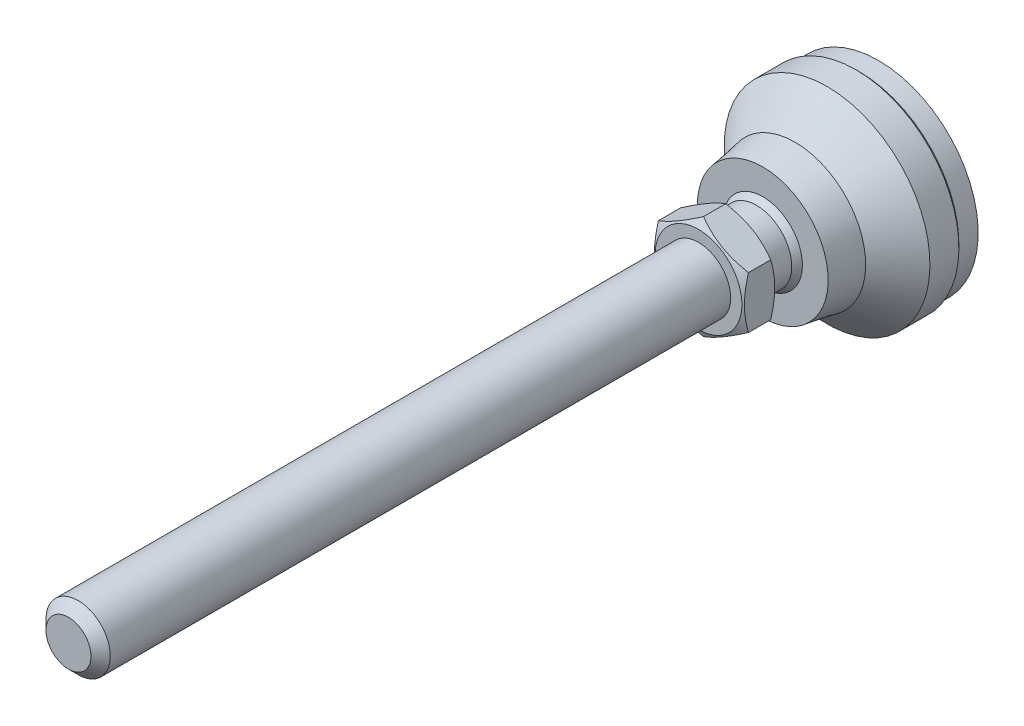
ISO-10303-21;
HEADER;
FILE_DESCRIPTION(('STEP AP214'),'2;1');
FILE_NAME('part.step','',(''),(''),'','','');
FILE_SCHEMA(('AUTOMOTIVE_DESIGN { 1 0 10303 214 1 1 1 1 }'));
ENDSEC;
DATA;
#1=APPLICATION_CONTEXT('core data for automotive mechanical design processes');
#2=APPLICATION_PROTOCOL_DEFINITION('international standard','automotive_design',2000,#1);
#3=PRODUCT_CONTEXT('',#1,'mechanical');
#4=PRODUCT('Part','Part','',(#3));
#5=PRODUCT_RELATED_PRODUCT_CATEGORY('part','',(#4));
#6=PRODUCT_DEFINITION_FORMATION('','',#4);
#7=PRODUCT_DEFINITION_CONTEXT('part definition',#1,'design');
#8=PRODUCT_DEFINITION('design','',#6,#7);
#9=PRODUCT_DEFINITION_SHAPE('','',#8);
#10=(LENGTH_UNIT() NAMED_UNIT(*) SI_UNIT(.MILLI.,.METRE.));
#11=(NAMED_UNIT(*) PLANE_ANGLE_UNIT() SI_UNIT($,.RADIAN.));
#12=(NAMED_UNIT(*) SI_UNIT($,.STERADIAN.) SOLID_ANGLE_UNIT());
#13=UNCERTAINTY_MEASURE_WITH_UNIT(LENGTH_MEASURE(1.E-05),#10,'distance_accuracy_value','');
#14=(GEOMETRIC_REPRESENTATION_CONTEXT(3) GLOBAL_UNCERTAINTY_ASSIGNED_CONTEXT((#13)) GLOBAL_UNIT_ASSIGNED_CONTEXT((#10,
#11,#12)) REPRESENTATION_CONTEXT('',''));
#15=CARTESIAN_POINT('',(0.,0.,0.));
#16=DIRECTION('',(0.,0.,1.));
#17=DIRECTION('',(1.,0.,0.));
#18=AXIS2_PLACEMENT_3D('',#15,#16,#17);
#19=CARTESIAN_POINT('',(0.,0.,3.));
#20=DIRECTION('',(0.,0.,-1.));
#21=DIRECTION('',(0.,1.,0.));
#22=AXIS2_PLACEMENT_3D('',#19,#20,#21);
#23=CYLINDRICAL_SURFACE('',#22,5.49999999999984);
#24=CARTESIAN_POINT('',(0.,0.,23.));
#25=DIRECTION('',(0.,0.,-1.));
#26=DIRECTION('',(0.,1.,0.));
#27=AXIS2_PLACEMENT_3D('',#24,#25,#26);
#28=CIRCLE('',#27,5.49999999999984);
#29=CARTESIAN_POINT('',(0.,5.49999999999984,23.));
#30=VERTEX_POINT('',#29);
#31=EDGE_CURVE('E112',#30,#30,#28,.T.);
#32=ORIENTED_EDGE('',*,*,#31,.T.);
#33=EDGE_LOOP('',(#32));
#34=FACE_BOUND('',#33,.T.);
#35=CARTESIAN_POINT('',(0.,0.,19.0000000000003));
#36=DIRECTION('',(0.,0.,1.));
#37=DIRECTION('',(0.,-1.,0.));
#38=AXIS2_PLACEMENT_3D('',#35,#36,#37);
#39=CIRCLE('',#38,5.49999999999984);
#40=CARTESIAN_POINT('',(-5.49999999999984,0.,19.0000000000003));
#41=VERTEX_POINT('',#40);
#42=EDGE_CURVE('E115',#41,#41,#39,.T.);
#43=ORIENTED_EDGE('',*,*,#42,.T.);
#44=EDGE_LOOP('',(#43));
#45=FACE_BOUND('',#44,.T.);
#46=ADVANCED_FACE('F14',(#34,#45),#23,.T.);
#47=CARTESIAN_POINT('',(0.,0.,14.6698729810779));
#48=DIRECTION('',(0.,0.,1.));
#49=DIRECTION('',(-1.,0.,0.));
#50=AXIS2_PLACEMENT_3D('',#47,#48,#49);
#51=SPHERICAL_SURFACE('',#50,7.);
#52=CARTESIAN_POINT('',(0.,0.,18.));
#53=DIRECTION('',(0.,0.,1.));
#54=DIRECTION('',(0.,-1.,0.));
#55=AXIS2_PLACEMENT_3D('',#52,#53,#54);
#56=CIRCLE('',#55,6.15713034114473);
#57=CARTESIAN_POINT('',(-6.15713034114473,0.,18.));
#58=VERTEX_POINT('',#57);
#59=EDGE_CURVE('E284',#58,#58,#56,.T.);
#60=CARTESIAN_POINT('',(-5.49999999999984,0.,19.0000000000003));
#61=CARTESIAN_POINT('',(-5.50771979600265,0.,18.9901945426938));
#62=CARTESIAN_POINT('',(-5.51541336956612,0.,18.9803684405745));
#63=CARTESIAN_POINT('',(-5.53074785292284,0.,18.9606752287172));
#64=CARTESIAN_POINT('',(-5.53838876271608,0.,18.9508081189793));
#65=CARTESIAN_POINT('',(-5.55361769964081,0.,18.9310331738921));
#66=CARTESIAN_POINT('',(-5.56120572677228,0.,18.9211253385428));
#67=CARTESIAN_POINT('',(-5.57632868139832,0.,18.9012692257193));
#68=CARTESIAN_POINT('',(-5.58386360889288,0.,18.8913209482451));
#69=CARTESIAN_POINT('',(-5.59888014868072,0.,18.871384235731));
#70=CARTESIAN_POINT('',(-5.60636176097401,0.,18.8613958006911));
#71=CARTESIAN_POINT('',(-5.62127145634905,0.,18.841379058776));
#72=CARTESIAN_POINT('',(-5.62869953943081,0.,18.8313507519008));
#73=CARTESIAN_POINT('',(-5.64350196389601,0.,18.81125455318));
#74=CARTESIAN_POINT('',(-5.65087630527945,0.,18.8011866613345));
#75=CARTESIAN_POINT('',(-5.66557103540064,0.,18.781011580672));
#76=CARTESIAN_POINT('',(-5.67289142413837,0.,18.770904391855));
#77=CARTESIAN_POINT('',(-5.68747803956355,0.,18.7506510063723));
#78=CARTESIAN_POINT('',(-5.69474426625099,0.,18.7405048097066));
#79=CARTESIAN_POINT('',(-5.70922234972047,0.,18.7201736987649));
#80=CARTESIAN_POINT('',(-5.7164342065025,0.,18.7099887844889));
#81=CARTESIAN_POINT('',(-5.7308033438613,0.,18.6895805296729));
#82=CARTESIAN_POINT('',(-5.73796062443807,0.,18.6793571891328));
#83=CARTESIAN_POINT('',(-5.75222040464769,0.,18.6588723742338));
#84=CARTESIAN_POINT('',(-5.75932290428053,0.,18.6486108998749));
#85=CARTESIAN_POINT('',(-5.77347291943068,0.,18.6280501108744));
#86=CARTESIAN_POINT('',(-5.78052043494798,0.,18.6177507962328));
#87=CARTESIAN_POINT('',(-5.79456028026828,0.,18.5971146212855));
#88=CARTESIAN_POINT('',(-5.80155261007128,0.,18.5867777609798));
#89=CARTESIAN_POINT('',(-5.81548188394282,0.,18.5660667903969));
#90=CARTESIAN_POINT('',(-5.82241882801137,0.,18.5556926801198));
#91=CARTESIAN_POINT('',(-5.83623713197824,0.,18.5349075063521));
#92=CARTESIAN_POINT('',(-5.84311849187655,0.,18.5244964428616));
#93=CARTESIAN_POINT('',(-5.85682543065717,0.,18.5036376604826));
#94=CARTESIAN_POINT('',(-5.86365100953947,0.,18.493189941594));
#95=CARTESIAN_POINT('',(-5.87724619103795,0.,18.4722581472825));
#96=CARTESIAN_POINT('',(-5.88401579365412,0.,18.4617740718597));
#97=CARTESIAN_POINT('',(-5.89749882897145,0.,18.4407698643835));
#98=CARTESIAN_POINT('',(-5.90421226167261,0.,18.4302497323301));
#99=CARTESIAN_POINT('',(-5.91758276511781,0.,18.4091737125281));
#100=CARTESIAN_POINT('',(-5.92423983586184,0.,18.3986178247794));
#101=CARTESIAN_POINT('',(-5.93749742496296,0.,18.3774705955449));
#102=CARTESIAN_POINT('',(-5.94409794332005,0.,18.366879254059));
#103=CARTESIAN_POINT('',(-5.95724223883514,0.,18.3456614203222));
#104=CARTESIAN_POINT('',(-5.96378601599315,0.,18.3350349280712));
#105=CARTESIAN_POINT('',(-5.9768166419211,0.,18.313747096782));
#106=CARTESIAN_POINT('',(-5.98330349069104,0.,18.3030857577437));
#107=CARTESIAN_POINT('',(-5.99622007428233,0.,18.2817285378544));
#108=CARTESIAN_POINT('',(-6.00264980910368,0.,18.2710326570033));
#109=CARTESIAN_POINT('',(-6.015451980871,0.,18.249606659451));
#110=CARTESIAN_POINT('',(-6.02182441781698,0.,18.2388765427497));
#111=CARTESIAN_POINT('',(-6.034511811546,0.,18.217382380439));
#112=CARTESIAN_POINT('',(-6.04082676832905,0.,18.2066183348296));
#113=CARTESIAN_POINT('',(-6.05339902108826,0.,18.1850566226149));
#114=CARTESIAN_POINT('',(-6.05965631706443,0.,18.1742589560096));
#115=CARTESIAN_POINT('',(-6.07211306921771,0.,18.1526303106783));
#116=CARTESIAN_POINT('',(-6.07831252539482,0.,18.1417993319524));
#117=CARTESIAN_POINT('',(-6.09065342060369,0.,18.1201043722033));
#118=CARTESIAN_POINT('',(-6.09679485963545,0.,18.1092403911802));
#119=CARTESIAN_POINT('',(-6.10901954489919,0.,18.0874797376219));
#120=CARTESIAN_POINT('',(-6.11510279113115,0.,18.0765830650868));
#121=CARTESIAN_POINT('',(-6.12721091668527,0.,18.054757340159));
#122=CARTESIAN_POINT('',(-6.13323579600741,0.,18.0438282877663));
#123=CARTESIAN_POINT('',(-6.14522701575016,0.,18.0219381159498));
#124=CARTESIAN_POINT('',(-6.15119335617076,0.,18.010976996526));
#125=CARTESIAN_POINT('',(-6.15713034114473,0.,18.));
#126=B_SPLINE_CURVE_WITH_KNOTS('',3,(#60,#61,#62,#63,#64,#65,#66,#67,#68,#69,#70,#71,#72,#73,
#74,#75,#76,#77,#78,#79,#80,#81,#82,#83,#84,#85,#86,#87,#88,#89,#90,#91,#92,#93,#94,#95,#96,#97,
#98,#99,#100,#101,#102,#103,#104,#105,#106,#107,#108,#109,#110,#111,#112,#113,#114,#115,#116,
#117,#118,#119,#120,#121,#122,#123,#124,#125),.UNSPECIFIED.,.F.,.F.,(4,2,2,2,2,2,2,2,2,2,2,2,2,
2,2,2,2,2,2,2,2,2,2,2,2,2,2,2,2,2,2,2,4),(0.,0.0374389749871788,0.0748779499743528,
0.112316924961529,0.149755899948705,0.187194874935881,0.224633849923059,0.262072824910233,
0.29951179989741,0.336950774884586,0.374389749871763,0.411828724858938,0.449267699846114,
0.486706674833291,0.524145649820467,0.561584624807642,0.599023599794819,0.636462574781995,
0.673901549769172,0.711340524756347,0.748779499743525,0.786218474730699,0.823657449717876,
0.86109642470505,0.898535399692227,0.935974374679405,0.973413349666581,1.01085232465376,
1.04829129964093,1.08573027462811,1.12316924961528,1.16060822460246,1.19804719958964),.UNSPECIFIED.);
#127=EDGE_CURVE('BSEAM243',#41,#58,#126,.T.);
#128=ORIENTED_EDGE('',*,*,#42,.F.);
#129=ORIENTED_EDGE('',*,*,#59,.T.);
#130=ORIENTED_EDGE('',*,*,#127,.T.);
#131=ORIENTED_EDGE('',*,*,#127,.F.);
#132=EDGE_LOOP('',(#128,#130,#129,#131));
#133=FACE_BOUND('',#132,.T.);
#134=ADVANCED_FACE('F243',(#133),#51,.T.);
#135=CARTESIAN_POINT('',(0.,0.,3.50000000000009));
#136=DIRECTION('',(0.,0.,1.));
#137=DIRECTION('',(0.,-1.,0.));
#138=AXIS2_PLACEMENT_3D('',#135,#136,#137);
#139=CONICAL_SURFACE('',#138,16.,0.785398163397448);
#140=CARTESIAN_POINT('',(0.,0.,3.00000000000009));
#141=DIRECTION('',(0.,0.,-1.));
#142=DIRECTION('',(0.,1.,0.));
#143=AXIS2_PLACEMENT_3D('',#140,#141,#142);
#144=CIRCLE('',#143,15.5);
#145=CARTESIAN_POINT('',(0.,15.5,3.00000000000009));
#146=VERTEX_POINT('',#145);
#147=EDGE_CURVE('E85',#146,#146,#144,.T.);
#148=ORIENTED_EDGE('',*,*,#147,.F.);
#149=EDGE_LOOP('',(#148));
#150=FACE_BOUND('',#149,.T.);
#151=CARTESIAN_POINT('',(0.,0.,3.50000000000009));
#152=DIRECTION('',(0.,0.,-1.));
#153=DIRECTION('',(0.,1.,0.));
#154=AXIS2_PLACEMENT_3D('',#151,#152,#153);
#155=CIRCLE('',#154,16.);
#156=CARTESIAN_POINT('',(0.,16.,3.50000000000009));
#157=VERTEX_POINT('',#156);
#158=EDGE_CURVE('E88',#157,#157,#155,.T.);
#159=ORIENTED_EDGE('',*,*,#158,.T.);
#160=EDGE_LOOP('',(#159));
#161=FACE_BOUND('',#160,.T.);
#162=ADVANCED_FACE('F246',(#150,#161),#139,.T.);
#163=CARTESIAN_POINT('',(0.,0.,3.));
#164=DIRECTION('',(0.,0.,-1.));
#165=DIRECTION('',(0.,1.,0.));
#166=AXIS2_PLACEMENT_3D('',#163,#164,#165);
#167=CYLINDRICAL_SURFACE('',#166,16.);
#168=ORIENTED_EDGE('',*,*,#158,.F.);
#169=EDGE_LOOP('',(#168));
#170=FACE_BOUND('',#169,.T.);
#171=CARTESIAN_POINT('',(0.,0.,8.00000000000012));
#172=DIRECTION('',(0.,0.,-1.));
#173=DIRECTION('',(0.,1.,0.));
#174=AXIS2_PLACEMENT_3D('',#171,#172,#173);
#175=CIRCLE('',#174,16.);
#176=CARTESIAN_POINT('',(0.,16.,8.00000000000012));
#177=VERTEX_POINT('',#176);
#178=EDGE_CURVE('E105',#177,#177,#175,.T.);
#179=ORIENTED_EDGE('',*,*,#178,.T.);
#180=EDGE_LOOP('',(#179));
#181=FACE_BOUND('',#180,.T.);
#182=ADVANCED_FACE('F391',(#170,#181),#167,.T.);
#183=CARTESIAN_POINT('',(0.,0.,13.));
#184=DIRECTION('',(0.,0.,-1.));
#185=DIRECTION('',(0.,1.,0.));
#186=AXIS2_PLACEMENT_3D('',#183,#184,#185);
#187=CONICAL_SURFACE('',#186,11.,0.785398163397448);
#188=ORIENTED_EDGE('',*,*,#178,.F.);
#189=EDGE_LOOP('',(#188));
#190=FACE_BOUND('',#189,.T.);
#191=CARTESIAN_POINT('',(0.,0.,13.));
#192=DIRECTION('',(0.,0.,-1.));
#193=DIRECTION('',(0.,1.,0.));
#194=AXIS2_PLACEMENT_3D('',#191,#192,#193);
#195=CIRCLE('',#194,11.);
#196=CARTESIAN_POINT('',(0.,11.,13.));
#197=VERTEX_POINT('',#196);
#198=EDGE_CURVE('E108',#197,#197,#195,.T.);
#199=ORIENTED_EDGE('',*,*,#198,.T.);
#200=EDGE_LOOP('',(#199));
#201=FACE_BOUND('',#200,.T.);
#202=ADVANCED_FACE('F398',(#190,#201),#187,.T.);
#203=CARTESIAN_POINT('',(0.,0.,19.));
#204=DIRECTION('',(0.,0.,-1.));
#205=DIRECTION('',(0.,1.,0.));
#206=AXIS2_PLACEMENT_3D('',#203,#204,#205);
#207=CONICAL_SURFACE('',#206,10.,0.165148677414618);
#208=ORIENTED_EDGE('',*,*,#198,.F.);
#209=EDGE_LOOP('',(#208));
#210=FACE_BOUND('',#209,.T.);
#211=CARTESIAN_POINT('',(0.,0.,18.));
#212=DIRECTION('',(0.,0.,-1.));
#213=DIRECTION('',(0.,1.,0.));
#214=AXIS2_PLACEMENT_3D('',#211,#212,#213);
#215=CIRCLE('',#214,10.1666666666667);
#216=CARTESIAN_POINT('',(0.,10.1666666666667,18.));
#217=VERTEX_POINT('',#216);
#218=EDGE_CURVE('E93',#217,#217,#215,.T.);
#219=ORIENTED_EDGE('',*,*,#218,.T.);
#220=EDGE_LOOP('',(#219));
#221=FACE_BOUND('',#220,.T.);
#222=ADVANCED_FACE('F241',(#210,#221),#207,.T.);
#223=CARTESIAN_POINT('',(-10.1666666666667,0.,18.));
#224=DIRECTION('',(0.,0.,1.));
#225=DIRECTION('',(0.,-1.,0.));
#226=AXIS2_PLACEMENT_3D('',#223,#224,#225);
#227=PLANE('',#226);
#228=ORIENTED_EDGE('',*,*,#218,.F.);
#229=EDGE_LOOP('',(#228));
#230=FACE_BOUND('',#229,.T.);
#231=ORIENTED_EDGE('',*,*,#59,.F.);
#232=EDGE_LOOP('',(#231));
#233=FACE_BOUND('',#232,.T.);
#234=ADVANCED_FACE('F236',(#230,#233),#227,.T.);
#235=CARTESIAN_POINT('',(0.,-8.08290376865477,23.));
#236=DIRECTION('',(0.,0.,-1.));
#237=DIRECTION('',(0.,1.,0.));
#238=AXIS2_PLACEMENT_3D('',#235,#236,#237);
#239=PLANE('',#238);
#240=CARTESIAN_POINT('',(0.,0.,23.));
#241=DIRECTION('',(0.,0.,1.));
#242=DIRECTION('',(0.,-1.,0.));
#243=AXIS2_PLACEMENT_3D('',#240,#241,#242);
#244=CIRCLE('',#243,6.75);
#245=CARTESIAN_POINT('',(0.,-6.75,23.));
#246=VERTEX_POINT('',#245);
#247=EDGE_CURVE('E80',#246,#246,#244,.T.);
#248=ORIENTED_EDGE('',*,*,#247,.F.);
#249=EDGE_LOOP('',(#248));
#250=FACE_BOUND('',#249,.T.);
#251=ORIENTED_EDGE('',*,*,#31,.F.);
#252=EDGE_LOOP('',(#251));
#253=FACE_BOUND('',#252,.T.);
#254=ADVANCED_FACE('F240',(#250,#253),#239,.T.);
#255=CARTESIAN_POINT('',(0.,0.,0.));
#256=DIRECTION('',(0.,0.,1.));
#257=DIRECTION('',(0.,-1.,0.));
#258=AXIS2_PLACEMENT_3D('',#255,#256,#257);
#259=CYLINDRICAL_SURFACE('',#258,15.5);
#260=CARTESIAN_POINT('',(0.,0.,0.));
#261=DIRECTION('',(0.,0.,-1.));
#262=DIRECTION('',(0.,1.,0.));
#263=AXIS2_PLACEMENT_3D('',#260,#261,#262);
#264=CIRCLE('',#263,15.5);
#265=CARTESIAN_POINT('',(0.,15.5,0.));
#266=VERTEX_POINT('',#265);
#267=EDGE_CURVE('E292',#266,#266,#264,.T.);
#268=ORIENTED_EDGE('',*,*,#267,.F.);
#269=EDGE_LOOP('',(#268));
#270=FACE_BOUND('',#269,.T.);
#271=ORIENTED_EDGE('',*,*,#147,.T.);
#272=EDGE_LOOP('',(#271));
#273=FACE_BOUND('',#272,.T.);
#274=ADVANCED_FACE('F250',(#270,#273),#259,.T.);
#275=CARTESIAN_POINT('',(0.,0.,0.));
#276=DIRECTION('',(0.,0.,-1.));
#277=DIRECTION('',(0.,1.,0.));
#278=AXIS2_PLACEMENT_3D('',#275,#276,#277);
#279=PLANE('',#278);
#280=ORIENTED_EDGE('',*,*,#267,.T.);
#281=EDGE_LOOP('',(#280));
#282=FACE_BOUND('',#281,.T.);
#283=ADVANCED_FACE('F133',(#282),#279,.T.);
#284=CARTESIAN_POINT('',(0.,0.,23.));
#285=DIRECTION('',(0.,0.,1.));
#286=DIRECTION('',(0.,-1.,0.));
#287=AXIS2_PLACEMENT_3D('',#284,#285,#286);
#288=CONICAL_SURFACE('',#287,6.75,1.0471975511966);
#289=CARTESIAN_POINT('',(7.0002,-4.04133641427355,23.7696190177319));
#290=CARTESIAN_POINT('',(6.84633209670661,-4.13017208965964,23.7183374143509));
#291=CARTESIAN_POINT('',(6.69189049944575,-4.21933898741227,23.669383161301));
#292=CARTESIAN_POINT('',(6.38175307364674,-4.3983969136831,23.5767703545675));
#293=CARTESIAN_POINT('',(6.22605673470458,-4.4882882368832,23.5331140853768));
#294=CARTESIAN_POINT('',(5.75647483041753,-4.7594014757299,23.4109491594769));
#295=CARTESIAN_POINT('',(5.4407356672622,-4.94169356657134,23.3414631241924));
#296=CARTESIAN_POINT('',(4.96823775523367,-5.21449036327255,23.2599825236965));
#297=CARTESIAN_POINT('',(4.81289077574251,-5.30417998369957,23.2367710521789));
#298=CARTESIAN_POINT('',(4.50149488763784,-5.48396448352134,23.1978487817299));
#299=CARTESIAN_POINT('',(4.34544604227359,-5.57405932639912,23.1821373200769));
#300=CARTESIAN_POINT('',(4.03307732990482,-5.75440548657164,23.1586154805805));
#301=CARTESIAN_POINT('',(3.87675797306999,-5.84465650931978,23.1507961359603));
#302=CARTESIAN_POINT('',(3.56398349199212,-6.02523694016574,23.1432178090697));
#303=CARTESIAN_POINT('',(3.40752837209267,-6.11556634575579,23.1434585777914));
#304=CARTESIAN_POINT('',(2.97889312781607,-6.36303901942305,23.155197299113));
#305=CARTESIAN_POINT('',(2.7068533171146,-6.52010127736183,23.1749033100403));
#306=CARTESIAN_POINT('',(2.1645805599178,-6.83318259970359,23.2373910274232));
#307=CARTESIAN_POINT('',(1.89434952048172,-6.98920056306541,23.2801940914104));
#308=CARTESIAN_POINT('',(1.35098545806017,-7.30291195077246,23.3871892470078));
#309=CARTESIAN_POINT('',(1.07792099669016,-7.46056579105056,23.4518346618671));
#310=CARTESIAN_POINT('',(0.535864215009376,-7.77352241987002,23.5985536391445));
#311=CARTESIAN_POINT('',(0.266864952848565,-7.92882921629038,23.680592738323));
#312=CARTESIAN_POINT('',(-0.000199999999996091,-8.08301923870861,23.7696190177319));
#313=B_SPLINE_CURVE_WITH_KNOTS('',3,(#289,#290,#291,#292,#293,#294,#295,#296,#297,#298,#299,
#300,#301,#302,#303,#304,#305,#306,#307,#308,#309,#310,#311,#312),.UNSPECIFIED.,.F.,.F.,(4,2,2,
2,2,2,2,2,2,2,2,4),(0.,0.554727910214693,1.10969417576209,2.2219327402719,2.76443041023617,
3.30688013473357,3.8487128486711,4.39052882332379,5.33376515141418,6.27787517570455,
7.24292418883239,8.20607866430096),.UNSPECIFIED.);
#314=CARTESIAN_POINT('',(7.,-4.04145188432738,23.7695523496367));
#315=VERTEX_POINT('',#314);
#316=CARTESIAN_POINT('',(0.,-8.08290376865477,23.7695523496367));
#317=VERTEX_POINT('',#316);
#318=EDGE_CURVE('E33',#315,#317,#313,.T.);
#319=ORIENTED_EDGE('',*,*,#318,.T.);
#320=CARTESIAN_POINT('',(0.000200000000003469,-8.0830192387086,23.7696190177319));
#321=CARTESIAN_POINT('',(-0.153667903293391,-7.99418356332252,23.7183374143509));
#322=CARTESIAN_POINT('',(-0.30810950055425,-7.90501666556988,23.669383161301));
#323=CARTESIAN_POINT('',(-0.618246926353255,-7.72595873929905,23.5767703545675));
#324=CARTESIAN_POINT('',(-0.773943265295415,-7.63606741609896,23.5331140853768));
#325=CARTESIAN_POINT('',(-1.24352516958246,-7.36495417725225,23.4109491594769));
#326=CARTESIAN_POINT('',(-1.5592643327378,-7.18266208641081,23.3414631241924));
#327=CARTESIAN_POINT('',(-2.03176224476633,-6.90986528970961,23.2599825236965));
#328=CARTESIAN_POINT('',(-2.18710922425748,-6.82017566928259,23.2367710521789));
#329=CARTESIAN_POINT('',(-2.49850511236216,-6.64039116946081,23.1978487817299));
#330=CARTESIAN_POINT('',(-2.65455395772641,-6.55029632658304,23.1821373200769));
#331=CARTESIAN_POINT('',(-2.96692267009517,-6.36995016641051,23.1586154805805));
#332=CARTESIAN_POINT('',(-3.12324202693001,-6.27969914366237,23.1507961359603));
#333=CARTESIAN_POINT('',(-3.43601650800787,-6.09911871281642,23.1432178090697));
#334=CARTESIAN_POINT('',(-3.59247162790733,-6.00878930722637,23.1434585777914));
#335=CARTESIAN_POINT('',(-4.02110687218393,-5.76131663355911,23.155197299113));
#336=CARTESIAN_POINT('',(-4.2931466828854,-5.60425437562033,23.1749033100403));
#337=CARTESIAN_POINT('',(-4.83541944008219,-5.29117305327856,23.2373910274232));
#338=CARTESIAN_POINT('',(-5.10565047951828,-5.13515508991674,23.2801940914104));
#339=CARTESIAN_POINT('',(-5.64901454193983,-4.82144370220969,23.3871892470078));
#340=CARTESIAN_POINT('',(-5.92207900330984,-4.6637898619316,23.4518346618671));
#341=CARTESIAN_POINT('',(-6.46413578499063,-4.35083323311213,23.5985536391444));
#342=CARTESIAN_POINT('',(-6.73313504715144,-4.19552643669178,23.680592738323));
#343=CARTESIAN_POINT('',(-7.0002,-4.04133641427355,23.7696190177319));
#344=B_SPLINE_CURVE_WITH_KNOTS('',3,(#320,#321,#322,#323,#324,#325,#326,#327,#328,#329,#330,
#331,#332,#333,#334,#335,#336,#337,#338,#339,#340,#341,#342,#343),.UNSPECIFIED.,.F.,.F.,(4,2,2,
2,2,2,2,2,2,2,2,4),(0.,0.554727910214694,1.10969417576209,2.2219327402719,2.76443041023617,
3.30688013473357,3.8487128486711,4.39052882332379,5.33376515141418,6.27787517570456,
7.24292418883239,8.20607866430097),.UNSPECIFIED.);
#345=CARTESIAN_POINT('',(-7.,-4.04145188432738,23.7695523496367));
#346=VERTEX_POINT('',#345);
#347=EDGE_CURVE('E9',#317,#346,#344,.T.);
#348=ORIENTED_EDGE('',*,*,#347,.T.);
#349=CARTESIAN_POINT('',(-7.,10.8714428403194,26.5680998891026));
#350=CARTESIAN_POINT('',(-7.,10.5655748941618,26.4196638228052));
#351=CARTESIAN_POINT('',(-7.,10.2590064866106,26.2726465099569));
#352=CARTESIAN_POINT('',(-7.,9.64409629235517,25.982247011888));
#353=CARTESIAN_POINT('',(-7.,9.33575423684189,25.8388653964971));
#354=CARTESIAN_POINT('',(-7.,8.71534312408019,25.5558169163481));
#355=CARTESIAN_POINT('',(-7.,8.40326292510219,25.4161743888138));
#356=CARTESIAN_POINT('',(-7.,7.77662585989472,25.142583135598));
#357=CARTESIAN_POINT('',(-7.,7.46206911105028,25.0086341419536));
#358=CARTESIAN_POINT('',(-7.,6.819766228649,24.7437206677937));
#359=CARTESIAN_POINT('',(-7.,6.49192219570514,24.6129922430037));
#360=CARTESIAN_POINT('',(-7.,5.83240514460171,24.3613916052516));
#361=CARTESIAN_POINT('',(-7.,5.50073170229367,24.2405204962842));
#362=CARTESIAN_POINT('',(-7.,4.83363989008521,24.0117964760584));
#363=CARTESIAN_POINT('',(-7.,4.49823060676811,23.9039173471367));
#364=CARTESIAN_POINT('',(-7.,3.82261272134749,23.7046272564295));
#365=CARTESIAN_POINT('',(-7.,3.48240566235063,23.6132111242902));
#366=CARTESIAN_POINT('',(-7.,2.79883358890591,23.4517167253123));
#367=CARTESIAN_POINT('',(-7.,2.45549679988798,23.3815222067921));
#368=CARTESIAN_POINT('',(-7.,1.93735219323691,23.2951775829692));
#369=CARTESIAN_POINT('',(-7.,1.76410129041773,23.2695527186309));
#370=CARTESIAN_POINT('',(-7.,1.41673382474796,23.2251211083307));
#371=CARTESIAN_POINT('',(-7.,1.24261735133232,23.2063136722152));
#372=CARTESIAN_POINT('',(-7.,0.89603247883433,23.1761281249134));
#373=CARTESIAN_POINT('',(-7.,0.723572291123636,23.1646561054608));
#374=CARTESIAN_POINT('',(-7.,0.37832130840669,23.1490161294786));
#375=CARTESIAN_POINT('',(-7.,0.205530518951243,23.1448480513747));
#376=CARTESIAN_POINT('',(-7.,-0.140072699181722,23.1439154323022));
#377=CARTESIAN_POINT('',(-7.,-0.312885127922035,23.1471509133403));
#378=CARTESIAN_POINT('',(-7.,-0.658219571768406,23.1609461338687));
#379=CARTESIAN_POINT('',(-7.,-0.830741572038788,23.1715062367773));
#380=CARTESIAN_POINT('',(-7.,-1.24488711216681,23.2054240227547));
#381=CARTESIAN_POINT('',(-7.,-1.48623420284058,23.2322304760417));
#382=CARTESIAN_POINT('',(-7.,-1.96713605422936,23.298718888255));
#383=CARTESIAN_POINT('',(-7.,-2.20669056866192,23.3384025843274));
#384=CARTESIAN_POINT('',(-7.,-2.92239177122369,23.4746652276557));
#385=CARTESIAN_POINT('',(-7.,-3.39530948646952,23.5884310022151));
#386=CARTESIAN_POINT('',(-7.,-4.10247316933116,23.7857047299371));
#387=CARTESIAN_POINT('',(-7.,-4.34038714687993,23.8568202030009));
#388=CARTESIAN_POINT('',(-7.,-4.81390432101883,24.0064362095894));
#389=CARTESIAN_POINT('',(-7.,-5.04950750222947,24.0849367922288));
#390=CARTESIAN_POINT('',(-7.,-5.51847725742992,24.2480635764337));
#391=CARTESIAN_POINT('',(-7.,-5.75184453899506,24.332687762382));
#392=CARTESIAN_POINT('',(-7.,-6.21664558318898,24.5070661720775));
#393=CARTESIAN_POINT('',(-7.,-6.4480793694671,24.5968203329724));
#394=CARTESIAN_POINT('',(-7.,-6.99824927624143,24.8160850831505));
#395=CARTESIAN_POINT('',(-7.,-7.31619810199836,24.9475675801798));
#396=CARTESIAN_POINT('',(-7.,-7.94935914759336,25.2169835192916));
#397=CARTESIAN_POINT('',(-7.,-8.26457119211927,25.3549173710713));
#398=CARTESIAN_POINT('',(-7.,-8.89276820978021,25.6359272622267));
#399=CARTESIAN_POINT('',(-7.,-9.20575269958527,25.779004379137));
#400=CARTESIAN_POINT('',(-7.,-9.82981717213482,26.0692608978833));
#401=CARTESIAN_POINT('',(-7.,-10.1408971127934,26.2164403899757));
#402=CARTESIAN_POINT('',(-7.,-10.7618025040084,26.5142848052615));
#403=CARTESIAN_POINT('',(-7.,-11.0716261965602,26.6649533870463));
#404=CARTESIAN_POINT('',(-7.,-11.6899312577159,26.9690226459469));
#405=CARTESIAN_POINT('',(-7.,-11.9984126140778,27.122423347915));
#406=CARTESIAN_POINT('',(-7.,-12.9220817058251,27.5859478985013));
#407=CARTESIAN_POINT('',(-7.,-13.5355809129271,27.8994360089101));
#408=CARTESIAN_POINT('',(-7.,-14.7072166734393,28.505740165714));
#409=CARTESIAN_POINT('',(-7.,-15.2656196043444,28.7980437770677));
#410=CARTESIAN_POINT('',(-7.,-16.3803571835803,29.3866151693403));
#411=CARTESIAN_POINT('',(-7.,-16.9366917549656,29.6828830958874));
#412=CARTESIAN_POINT('',(-7.,-18.0463309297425,30.2776722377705));
#413=CARTESIAN_POINT('',(-7.,-18.5996396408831,30.5761858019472));
#414=CARTESIAN_POINT('',(-7.,-19.7049372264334,31.1755732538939));
#415=CARTESIAN_POINT('',(-7.,-20.2569261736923,31.4764470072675));
#416=CARTESIAN_POINT('',(-7.,-20.8084307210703,31.778200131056));
#417=B_SPLINE_CURVE_WITH_KNOTS('',3,(#349,#350,#351,#352,#353,#354,#355,#356,#357,#358,#359,
#360,#361,#362,#363,#364,#365,#366,#367,#368,#369,#370,#371,#372,#373,#374,#375,#376,#377,#378,
#379,#380,#381,#382,#383,#384,#385,#386,#387,#388,#389,#390,#391,#392,#393,#394,#395,#396,#397,
#398,#399,#400,#401,#402,#403,#404,#405,#406,#407,#408,#409,#410,#411,#412,#413,#414,#415,#416),
.UNSPECIFIED.,.F.,.F.,(4,2,2,2,2,2,2,2,2,2,2,2,2,2,2,2,2,2,2,2,2,2,2,2,2,2,2,2,2,2,2,2,2,4),(0.,
1.01996149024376,2.04008186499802,3.06572959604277,4.09132900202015,5.15004718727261,
6.20888378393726,7.26554652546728,8.32187683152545,9.37231111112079,9.89760515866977,
10.4228460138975,10.9412204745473,11.4595863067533,11.9779536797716,12.4963467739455,
13.2244293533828,13.9526101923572,15.4097715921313,16.1546551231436,16.8995436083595,
17.6441880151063,18.3888233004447,19.4209145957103,20.4530715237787,21.4854459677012,
22.5178431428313,23.5513768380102,24.5849199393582,26.6517180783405,28.5425467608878,
30.4334450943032,32.3195322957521,34.2055128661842),.UNSPECIFIED.);
#418=CARTESIAN_POINT('',(-7.,4.04145188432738,23.7695523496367));
#419=VERTEX_POINT('',#418);
#420=EDGE_CURVE('E72',#346,#419,#417,.F.);
#421=ORIENTED_EDGE('',*,*,#420,.T.);
#422=CARTESIAN_POINT('',(-7.0002,4.04133641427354,23.7696190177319));
#423=CARTESIAN_POINT('',(-6.84633209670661,4.13017208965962,23.7183374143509));
#424=CARTESIAN_POINT('',(-6.69189049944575,4.21933898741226,23.669383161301));
#425=CARTESIAN_POINT('',(-6.38175307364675,4.39839691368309,23.5767703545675));
#426=CARTESIAN_POINT('',(-6.22605673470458,4.48828823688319,23.5331140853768));
#427=CARTESIAN_POINT('',(-5.75647483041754,4.75940147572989,23.4109491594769));
#428=CARTESIAN_POINT('',(-5.4407356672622,4.94169356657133,23.3414631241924));
#429=CARTESIAN_POINT('',(-4.96823775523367,5.21449036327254,23.2599825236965));
#430=CARTESIAN_POINT('',(-4.81289077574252,5.30417998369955,23.2367710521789));
#431=CARTESIAN_POINT('',(-4.50149488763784,5.48396448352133,23.1978487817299));
#432=CARTESIAN_POINT('',(-4.34544604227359,5.57405932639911,23.1821373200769));
#433=CARTESIAN_POINT('',(-4.03307732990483,5.75440548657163,23.1586154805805));
#434=CARTESIAN_POINT('',(-3.87675797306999,5.84465650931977,23.1507961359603));
#435=CARTESIAN_POINT('',(-3.56398349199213,6.02523694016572,23.1432178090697));
#436=CARTESIAN_POINT('',(-3.40752837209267,6.11556634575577,23.1434585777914));
#437=CARTESIAN_POINT('',(-2.97889312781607,6.36303901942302,23.155197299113));
#438=CARTESIAN_POINT('',(-2.7068533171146,6.52010127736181,23.1749033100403));
#439=CARTESIAN_POINT('',(-2.16458055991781,6.83318259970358,23.2373910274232));
#440=CARTESIAN_POINT('',(-1.89434952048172,6.9892005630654,23.2801940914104));
#441=CARTESIAN_POINT('',(-1.35098545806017,7.30291195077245,23.3871892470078));
#442=CARTESIAN_POINT('',(-1.07792099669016,7.46056579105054,23.4518346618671));
#443=CARTESIAN_POINT('',(-0.535864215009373,7.77352241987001,23.5985536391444));
#444=CARTESIAN_POINT('',(-0.266864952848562,7.92882921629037,23.680592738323));
#445=CARTESIAN_POINT('',(0.000199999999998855,8.0830192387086,23.7696190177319));
#446=B_SPLINE_CURVE_WITH_KNOTS('',3,(#422,#423,#424,#425,#426,#427,#428,#429,#430,#431,#432,
#433,#434,#435,#436,#437,#438,#439,#440,#441,#442,#443,#444,#445),.UNSPECIFIED.,.F.,.F.,(4,2,2,
2,2,2,2,2,2,2,2,4),(0.,0.554727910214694,1.10969417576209,2.2219327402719,2.76443041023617,
3.30688013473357,3.84871284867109,4.39052882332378,5.33376515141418,6.27787517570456,
7.2429241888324,8.20607866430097),.UNSPECIFIED.);
#447=CARTESIAN_POINT('',(0.,8.08290376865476,23.7695523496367));
#448=VERTEX_POINT('',#447);
#449=EDGE_CURVE('E79',#419,#448,#446,.T.);
#450=ORIENTED_EDGE('',*,*,#449,.T.);
#451=CARTESIAN_POINT('',(-0.000200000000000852,8.0830192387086,23.7696190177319));
#452=CARTESIAN_POINT('',(0.153667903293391,7.99418356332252,23.7183374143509));
#453=CARTESIAN_POINT('',(0.308109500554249,7.90501666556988,23.669383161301));
#454=CARTESIAN_POINT('',(0.618246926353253,7.72595873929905,23.5767703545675));
#455=CARTESIAN_POINT('',(0.773943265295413,7.63606741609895,23.5331140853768));
#456=CARTESIAN_POINT('',(1.24352516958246,7.36495417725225,23.4109491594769));
#457=CARTESIAN_POINT('',(1.5592643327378,7.18266208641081,23.3414631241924));
#458=CARTESIAN_POINT('',(2.03176224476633,6.9098652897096,23.2599825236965));
#459=CARTESIAN_POINT('',(2.18710922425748,6.82017566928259,23.2367710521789));
#460=CARTESIAN_POINT('',(2.49850511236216,6.64039116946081,23.1978487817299));
#461=CARTESIAN_POINT('',(2.6545539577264,6.55029632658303,23.1821373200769));
#462=CARTESIAN_POINT('',(2.96692267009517,6.36995016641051,23.1586154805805));
#463=CARTESIAN_POINT('',(3.12324202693,6.27969914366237,23.1507961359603));
#464=CARTESIAN_POINT('',(3.43601650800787,6.09911871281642,23.1432178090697));
#465=CARTESIAN_POINT('',(3.59247162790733,6.00878930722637,23.1434585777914));
#466=CARTESIAN_POINT('',(4.02110687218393,5.76131663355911,23.155197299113));
#467=CARTESIAN_POINT('',(4.29314668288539,5.60425437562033,23.1749033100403));
#468=CARTESIAN_POINT('',(4.83541944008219,5.29117305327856,23.2373910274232));
#469=CARTESIAN_POINT('',(5.10565047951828,5.13515508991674,23.2801940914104));
#470=CARTESIAN_POINT('',(5.64901454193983,4.82144370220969,23.3871892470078));
#471=CARTESIAN_POINT('',(5.92207900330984,4.66378986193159,23.4518346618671));
#472=CARTESIAN_POINT('',(6.46413578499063,4.35083323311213,23.5985536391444));
#473=CARTESIAN_POINT('',(6.73313504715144,4.19552643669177,23.680592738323));
#474=CARTESIAN_POINT('',(7.0002,4.04133641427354,23.7696190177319));
#475=B_SPLINE_CURVE_WITH_KNOTS('',3,(#451,#452,#453,#454,#455,#456,#457,#458,#459,#460,#461,
#462,#463,#464,#465,#466,#467,#468,#469,#470,#471,#472,#473,#474),.UNSPECIFIED.,.F.,.F.,(4,2,2,
2,2,2,2,2,2,2,2,4),(0.,0.554727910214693,1.10969417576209,2.22193274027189,2.76443041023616,
3.30688013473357,3.84871284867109,4.39052882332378,5.33376515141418,6.27787517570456,
7.2429241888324,8.20607866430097),.UNSPECIFIED.);
#476=CARTESIAN_POINT('',(7.,4.04145188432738,23.7695523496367));
#477=VERTEX_POINT('',#476);
#478=EDGE_CURVE('E194',#448,#477,#475,.T.);
#479=ORIENTED_EDGE('',*,*,#478,.T.);
#480=CARTESIAN_POINT('',(7.,10.8714428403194,26.5680998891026));
#481=CARTESIAN_POINT('',(7.,10.5655748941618,26.4196638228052));
#482=CARTESIAN_POINT('',(7.,10.2590064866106,26.2726465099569));
#483=CARTESIAN_POINT('',(7.,9.64409629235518,25.982247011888));
#484=CARTESIAN_POINT('',(7.,9.33575423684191,25.8388653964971));
#485=CARTESIAN_POINT('',(7.,8.7153431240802,25.5558169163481));
#486=CARTESIAN_POINT('',(7.,8.40326292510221,25.4161743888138));
#487=CARTESIAN_POINT('',(7.,7.77662585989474,25.142583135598));
#488=CARTESIAN_POINT('',(7.,7.4620691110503,25.0086341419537));
#489=CARTESIAN_POINT('',(7.,6.81976622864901,24.7437206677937));
#490=CARTESIAN_POINT('',(7.,6.49192219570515,24.6129922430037));
#491=CARTESIAN_POINT('',(7.,5.83240514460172,24.3613916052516));
#492=CARTESIAN_POINT('',(7.,5.50073170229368,24.2405204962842));
#493=CARTESIAN_POINT('',(7.,4.83363989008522,24.0117964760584));
#494=CARTESIAN_POINT('',(7.,4.49823060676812,23.9039173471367));
#495=CARTESIAN_POINT('',(7.,3.8226127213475,23.7046272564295));
#496=CARTESIAN_POINT('',(7.,3.48240566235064,23.6132111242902));
#497=CARTESIAN_POINT('',(7.,2.79883358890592,23.4517167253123));
#498=CARTESIAN_POINT('',(7.,2.45549679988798,23.3815222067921));
#499=CARTESIAN_POINT('',(7.,1.93735219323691,23.2951775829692));
#500=CARTESIAN_POINT('',(7.,1.76410129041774,23.2695527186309));
#501=CARTESIAN_POINT('',(7.,1.41673382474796,23.2251211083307));
#502=CARTESIAN_POINT('',(7.,1.24261735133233,23.2063136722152));
#503=CARTESIAN_POINT('',(7.,0.896032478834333,23.1761281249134));
#504=CARTESIAN_POINT('',(7.,0.72357229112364,23.1646561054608));
#505=CARTESIAN_POINT('',(7.,0.378321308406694,23.1490161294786));
#506=CARTESIAN_POINT('',(7.,0.205530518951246,23.1448480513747));
#507=CARTESIAN_POINT('',(7.,-0.14007269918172,23.1439154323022));
#508=CARTESIAN_POINT('',(7.,-0.312885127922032,23.1471509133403));
#509=CARTESIAN_POINT('',(7.,-0.658219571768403,23.1609461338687));
#510=CARTESIAN_POINT('',(7.,-0.830741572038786,23.1715062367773));
#511=CARTESIAN_POINT('',(7.,-1.24488711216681,23.2054240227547));
#512=CARTESIAN_POINT('',(7.,-1.48623420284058,23.2322304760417));
#513=CARTESIAN_POINT('',(7.,-1.96713605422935,23.298718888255));
#514=CARTESIAN_POINT('',(7.,-2.20669056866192,23.3384025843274));
#515=CARTESIAN_POINT('',(7.,-2.92239177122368,23.4746652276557));
#516=CARTESIAN_POINT('',(7.,-3.39530948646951,23.5884310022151));
#517=CARTESIAN_POINT('',(7.,-4.10247316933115,23.7857047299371));
#518=CARTESIAN_POINT('',(7.,-4.34038714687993,23.8568202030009));
#519=CARTESIAN_POINT('',(7.,-4.81390432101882,24.0064362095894));
#520=CARTESIAN_POINT('',(7.,-5.04950750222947,24.0849367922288));
#521=CARTESIAN_POINT('',(7.,-5.51847725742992,24.2480635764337));
#522=CARTESIAN_POINT('',(7.,-5.75184453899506,24.332687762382));
#523=CARTESIAN_POINT('',(7.,-6.21664558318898,24.5070661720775));
#524=CARTESIAN_POINT('',(7.,-6.44807936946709,24.5968203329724));
#525=CARTESIAN_POINT('',(7.,-6.99824927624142,24.8160850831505));
#526=CARTESIAN_POINT('',(7.,-7.31619810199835,24.9475675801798));
#527=CARTESIAN_POINT('',(7.,-7.94935914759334,25.2169835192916));
#528=CARTESIAN_POINT('',(7.,-8.26457119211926,25.3549173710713));
#529=CARTESIAN_POINT('',(7.,-8.8927682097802,25.6359272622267));
#530=CARTESIAN_POINT('',(7.,-9.20575269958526,25.779004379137));
#531=CARTESIAN_POINT('',(7.,-9.82981717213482,26.0692608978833));
#532=CARTESIAN_POINT('',(7.,-10.1408971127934,26.2164403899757));
#533=CARTESIAN_POINT('',(7.,-10.7618025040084,26.5142848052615));
#534=CARTESIAN_POINT('',(7.,-11.0716261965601,26.6649533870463));
#535=CARTESIAN_POINT('',(7.,-11.6899312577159,26.9690226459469));
#536=CARTESIAN_POINT('',(7.,-11.9984126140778,27.122423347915));
#537=CARTESIAN_POINT('',(7.,-12.9220817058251,27.5859478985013));
#538=CARTESIAN_POINT('',(7.,-13.5355809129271,27.8994360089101));
#539=CARTESIAN_POINT('',(7.,-14.7072166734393,28.505740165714));
#540=CARTESIAN_POINT('',(7.,-15.2656196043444,28.7980437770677));
#541=CARTESIAN_POINT('',(7.,-16.3803571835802,29.3866151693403));
#542=CARTESIAN_POINT('',(7.,-16.9366917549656,29.6828830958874));
#543=CARTESIAN_POINT('',(7.,-18.0463309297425,30.2776722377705));
#544=CARTESIAN_POINT('',(7.,-18.5996396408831,30.5761858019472));
#545=CARTESIAN_POINT('',(7.,-19.7049372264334,31.1755732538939));
#546=CARTESIAN_POINT('',(7.,-20.2569261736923,31.4764470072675));
#547=CARTESIAN_POINT('',(7.,-20.8084307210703,31.778200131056));
#548=B_SPLINE_CURVE_WITH_KNOTS('',3,(#480,#481,#482,#483,#484,#485,#486,#487,#488,#489,#490,
#491,#492,#493,#494,#495,#496,#497,#498,#499,#500,#501,#502,#503,#504,#505,#506,#507,#508,#509,
#510,#511,#512,#513,#514,#515,#516,#517,#518,#519,#520,#521,#522,#523,#524,#525,#526,#527,#528,
#529,#530,#531,#532,#533,#534,#535,#536,#537,#538,#539,#540,#541,#542,#543,#544,#545,#546,#547),
.UNSPECIFIED.,.F.,.F.,(4,2,2,2,2,2,2,2,2,2,2,2,2,2,2,2,2,2,2,2,2,2,2,2,2,2,2,2,2,2,2,2,2,4),(0.,
1.01996149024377,2.04008186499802,3.06572959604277,4.09132900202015,5.15004718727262,
6.20888378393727,7.26554652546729,8.32187683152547,9.37231111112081,9.89760515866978,
10.4228460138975,10.9412204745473,11.4595863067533,11.9779536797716,12.4963467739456,
13.2244293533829,13.9526101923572,15.4097715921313,16.1546551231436,16.8995436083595,
17.6441880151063,18.3888233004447,19.4209145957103,20.4530715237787,21.4854459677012,
22.5178431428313,23.5513768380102,24.5849199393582,26.6517180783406,28.5425467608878,
30.4334450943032,32.3195322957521,34.2055128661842),.UNSPECIFIED.);
#549=EDGE_CURVE('E187',#477,#315,#548,.T.);
#550=ORIENTED_EDGE('',*,*,#549,.T.);
#551=EDGE_LOOP('',(#319,#348,#421,#450,#479,#550));
#552=FACE_BOUND('',#551,.T.);
#553=ORIENTED_EDGE('',*,*,#247,.T.);
#554=EDGE_LOOP('',(#553));
#555=FACE_BOUND('',#554,.T.);
#556=ADVANCED_FACE('F70',(#552,#555),#288,.T.);
#557=CARTESIAN_POINT('',(0.,0.,126.));
#558=DIRECTION('',(0.,0.,-1.));
#559=DIRECTION('',(0.,1.,0.));
#560=AXIS2_PLACEMENT_3D('',#557,#558,#559);
#561=PLANE('',#560);
#562=CARTESIAN_POINT('',(0.,0.,126.));
#563=DIRECTION('',(0.,0.,-1.));
#564=DIRECTION('',(0.,1.,0.));
#565=AXIS2_PLACEMENT_3D('',#562,#563,#564);
#566=CIRCLE('',#565,3.5);
#567=CARTESIAN_POINT('',(0.,3.5,126.));
#568=VERTEX_POINT('',#567);
#569=EDGE_CURVE('E116',#568,#568,#566,.T.);
#570=ORIENTED_EDGE('',*,*,#569,.F.);
#571=EDGE_LOOP('',(#570));
#572=FACE_BOUND('',#571,.T.);
#573=ADVANCED_FACE('F255',(#572),#561,.F.);
#574=CARTESIAN_POINT('',(0.,0.,126.));
#575=DIRECTION('',(0.,0.,-1.));
#576=DIRECTION('',(0.,1.,0.));
#577=AXIS2_PLACEMENT_3D('',#574,#575,#576);
#578=CONICAL_SURFACE('',#577,3.5,0.785398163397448);
#579=CARTESIAN_POINT('',(0.,0.,124.5));
#580=DIRECTION('',(0.,0.,-1.));
#581=DIRECTION('',(0.,1.,0.));
#582=AXIS2_PLACEMENT_3D('',#579,#580,#581);
#583=CIRCLE('',#582,5.);
#584=CARTESIAN_POINT('',(0.,5.,124.5));
#585=VERTEX_POINT('',#584);
#586=EDGE_CURVE('E290',#585,#585,#583,.T.);
#587=ORIENTED_EDGE('',*,*,#586,.F.);
#588=EDGE_LOOP('',(#587));
#589=FACE_BOUND('',#588,.T.);
#590=ORIENTED_EDGE('',*,*,#569,.T.);
#591=EDGE_LOOP('',(#590));
#592=FACE_BOUND('',#591,.T.);
#593=ADVANCED_FACE('F258',(#589,#592),#578,.T.);
#594=CARTESIAN_POINT('',(0.,0.,3.));
#595=DIRECTION('',(0.,0.,-1.));
#596=DIRECTION('',(0.,1.,0.));
#597=AXIS2_PLACEMENT_3D('',#594,#595,#596);
#598=CYLINDRICAL_SURFACE('',#597,5.);
#599=CARTESIAN_POINT('',(0.,0.,28.));
#600=DIRECTION('',(0.,0.,-1.));
#601=DIRECTION('',(0.,1.,0.));
#602=AXIS2_PLACEMENT_3D('',#599,#600,#601);
#603=CIRCLE('',#602,5.);
#604=CARTESIAN_POINT('',(0.,5.,28.));
#605=VERTEX_POINT('',#604);
#606=EDGE_CURVE('E111',#605,#605,#603,.F.);
#607=ORIENTED_EDGE('',*,*,#606,.T.);
#608=EDGE_LOOP('',(#607));
#609=FACE_BOUND('',#608,.T.);
#610=ORIENTED_EDGE('',*,*,#586,.T.);
#611=EDGE_LOOP('',(#610));
#612=FACE_BOUND('',#611,.T.);
#613=ADVANCED_FACE('F254',(#609,#612),#598,.T.);
#614=CARTESIAN_POINT('',(-7.,12.1243556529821,28.));
#615=DIRECTION('',(0.,0.,-1.));
#616=DIRECTION('',(0.,1.,0.));
#617=AXIS2_PLACEMENT_3D('',#614,#615,#616);
#618=PLANE('',#617);
#619=CARTESIAN_POINT('',(0.,0.,28.));
#620=DIRECTION('',(0.,0.,1.));
#621=DIRECTION('',(0.,-1.,0.));
#622=AXIS2_PLACEMENT_3D('',#619,#620,#621);
#623=CIRCLE('',#622,6.75);
#624=CARTESIAN_POINT('',(0.,-6.75,28.));
#625=VERTEX_POINT('',#624);
#626=EDGE_CURVE('E204',#625,#625,#623,.T.);
#627=ORIENTED_EDGE('',*,*,#626,.T.);
#628=EDGE_LOOP('',(#627));
#629=FACE_BOUND('',#628,.T.);
#630=ORIENTED_EDGE('',*,*,#606,.F.);
#631=EDGE_LOOP('',(#630));
#632=FACE_BOUND('',#631,.T.);
#633=ADVANCED_FACE('F130',(#629,#632),#618,.F.);
#634=CARTESIAN_POINT('',(0.,0.,25.989028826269));
#635=DIRECTION('',(0.,0.,-1.));
#636=DIRECTION('',(0.,1.,0.));
#637=AXIS2_PLACEMENT_3D('',#634,#635,#636);
#638=CONICAL_SURFACE('',#637,10.2331042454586,1.0471975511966);
#639=CARTESIAN_POINT('',(-0.000199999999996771,-8.08301923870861,27.2303809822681));
#640=CARTESIAN_POINT('',(0.153667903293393,-7.99418356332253,27.2816625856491));
#641=CARTESIAN_POINT('',(0.308109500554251,-7.9050166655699,27.330616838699));
#642=CARTESIAN_POINT('',(0.618246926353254,-7.72595873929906,27.4232296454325));
#643=CARTESIAN_POINT('',(0.773943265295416,-7.63606741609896,27.4668859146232));
#644=CARTESIAN_POINT('',(1.24352516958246,-7.36495417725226,27.5890508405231));
#645=CARTESIAN_POINT('',(1.5592643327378,-7.18266208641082,27.6585368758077));
#646=CARTESIAN_POINT('',(2.03176224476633,-6.90986528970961,27.7400174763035));
#647=CARTESIAN_POINT('',(2.18710922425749,-6.8201756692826,27.7632289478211));
#648=CARTESIAN_POINT('',(2.49850511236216,-6.64039116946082,27.8021512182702));
#649=CARTESIAN_POINT('',(2.65455395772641,-6.55029632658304,27.8178626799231));
#650=CARTESIAN_POINT('',(2.96692267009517,-6.36995016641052,27.8413845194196));
#651=CARTESIAN_POINT('',(3.12324202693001,-6.27969914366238,27.8492038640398));
#652=CARTESIAN_POINT('',(3.43601650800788,-6.09911871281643,27.8567821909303));
#653=CARTESIAN_POINT('',(3.59247162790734,-6.00878930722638,27.8565414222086));
#654=CARTESIAN_POINT('',(4.02110687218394,-5.76131663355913,27.844802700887));
#655=CARTESIAN_POINT('',(4.2931466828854,-5.60425437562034,27.8250966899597));
#656=CARTESIAN_POINT('',(4.8354194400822,-5.29117305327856,27.7626089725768));
#657=CARTESIAN_POINT('',(5.10565047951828,-5.13515508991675,27.7198059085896));
#658=CARTESIAN_POINT('',(5.64901454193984,-4.8214437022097,27.6128107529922));
#659=CARTESIAN_POINT('',(5.92207900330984,-4.6637898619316,27.5481653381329));
#660=CARTESIAN_POINT('',(6.46413578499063,-4.35083323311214,27.4014463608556));
#661=CARTESIAN_POINT('',(6.73313504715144,-4.19552643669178,27.319407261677));
#662=CARTESIAN_POINT('',(7.0002,-4.04133641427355,27.2303809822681));
#663=B_SPLINE_CURVE_WITH_KNOTS('',3,(#639,#640,#641,#642,#643,#644,#645,#646,#647,#648,#649,
#650,#651,#652,#653,#654,#655,#656,#657,#658,#659,#660,#661,#662),.UNSPECIFIED.,.F.,.F.,(4,2,2,
2,2,2,2,2,2,2,2,4),(0.,0.554727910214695,1.10969417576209,2.2219327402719,2.76443041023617,
3.30688013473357,3.8487128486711,4.39052882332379,5.33376515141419,6.27787517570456,
7.2429241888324,8.20607866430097),.UNSPECIFIED.);
#664=CARTESIAN_POINT('',(0.,-8.08290376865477,27.2304476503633));
#665=VERTEX_POINT('',#664);
#666=CARTESIAN_POINT('',(7.,-4.04145188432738,27.2304476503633));
#667=VERTEX_POINT('',#666);
#668=EDGE_CURVE('E171',#665,#667,#663,.T.);
#669=ORIENTED_EDGE('',*,*,#668,.T.);
#670=CARTESIAN_POINT('',(7.,10.8714428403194,24.4319001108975));
#671=CARTESIAN_POINT('',(7.,10.5655748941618,24.5803361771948));
#672=CARTESIAN_POINT('',(7.,10.2590064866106,24.7273534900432));
#673=CARTESIAN_POINT('',(7.,9.64409629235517,25.017752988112));
#674=CARTESIAN_POINT('',(7.,9.3357542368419,25.161134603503));
#675=CARTESIAN_POINT('',(7.,8.71534312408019,25.444183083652));
#676=CARTESIAN_POINT('',(7.,8.4032629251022,25.5838256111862));
#677=CARTESIAN_POINT('',(7.,7.77662585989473,25.857416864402));
#678=CARTESIAN_POINT('',(7.,7.46206911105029,25.9913658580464));
#679=CARTESIAN_POINT('',(7.,6.81976622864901,26.2562793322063));
#680=CARTESIAN_POINT('',(7.,6.49192219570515,26.3870077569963));
#681=CARTESIAN_POINT('',(7.,5.83240514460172,26.6386083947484));
#682=CARTESIAN_POINT('',(7.,5.50073170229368,26.7594795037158));
#683=CARTESIAN_POINT('',(7.,4.83363989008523,26.9882035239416));
#684=CARTESIAN_POINT('',(7.,4.49823060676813,27.0960826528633));
#685=CARTESIAN_POINT('',(7.,3.82261272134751,27.2953727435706));
#686=CARTESIAN_POINT('',(7.,3.48240566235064,27.3867888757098));
#687=CARTESIAN_POINT('',(7.,2.79883358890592,27.5482832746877));
#688=CARTESIAN_POINT('',(7.,2.45549679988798,27.6184777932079));
#689=CARTESIAN_POINT('',(7.,1.93735219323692,27.7048224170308));
#690=CARTESIAN_POINT('',(7.,1.76410129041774,27.7304472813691));
#691=CARTESIAN_POINT('',(7.,1.41673382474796,27.7748788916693));
#692=CARTESIAN_POINT('',(7.,1.24261735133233,27.7936863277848));
#693=CARTESIAN_POINT('',(7.,0.896032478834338,27.8238718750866));
#694=CARTESIAN_POINT('',(7.,0.723572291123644,27.8353438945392));
#695=CARTESIAN_POINT('',(7.,0.378321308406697,27.8509838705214));
#696=CARTESIAN_POINT('',(7.,0.205530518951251,27.8551519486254));
#697=CARTESIAN_POINT('',(7.,-0.140072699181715,27.8560845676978));
#698=CARTESIAN_POINT('',(7.,-0.312885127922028,27.8528490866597));
#699=CARTESIAN_POINT('',(7.,-0.6582195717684,27.8390538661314));
#700=CARTESIAN_POINT('',(7.,-0.830741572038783,27.8284937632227));
#701=CARTESIAN_POINT('',(7.,-1.24488711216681,27.7945759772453));
#702=CARTESIAN_POINT('',(7.,-1.48623420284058,27.7677695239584));
#703=CARTESIAN_POINT('',(7.,-1.96713605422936,27.701281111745));
#704=CARTESIAN_POINT('',(7.,-2.20669056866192,27.6615974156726));
#705=CARTESIAN_POINT('',(7.,-2.92239177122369,27.5253347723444));
#706=CARTESIAN_POINT('',(7.,-3.39530948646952,27.4115689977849));
#707=CARTESIAN_POINT('',(7.,-4.10247316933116,27.214295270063));
#708=CARTESIAN_POINT('',(7.,-4.34038714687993,27.1431797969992));
#709=CARTESIAN_POINT('',(7.,-4.81390432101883,26.9935637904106));
#710=CARTESIAN_POINT('',(7.,-5.04950750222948,26.9150632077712));
#711=CARTESIAN_POINT('',(7.,-5.51847725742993,26.7519364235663));
#712=CARTESIAN_POINT('',(7.,-5.75184453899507,26.6673122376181));
#713=CARTESIAN_POINT('',(7.,-6.21664558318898,26.4929338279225));
#714=CARTESIAN_POINT('',(7.,-6.44807936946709,26.4031796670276));
#715=CARTESIAN_POINT('',(7.,-6.99824927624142,26.1839149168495));
#716=CARTESIAN_POINT('',(7.,-7.31619810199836,26.0524324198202));
#717=CARTESIAN_POINT('',(7.,-7.94935914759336,25.7830164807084));
#718=CARTESIAN_POINT('',(7.,-8.26457119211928,25.6450826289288));
#719=CARTESIAN_POINT('',(7.,-8.89276820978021,25.3640727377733));
#720=CARTESIAN_POINT('',(7.,-9.20575269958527,25.220995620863));
#721=CARTESIAN_POINT('',(7.,-9.82981717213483,24.9307391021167));
#722=CARTESIAN_POINT('',(7.,-10.1408971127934,24.7835596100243));
#723=CARTESIAN_POINT('',(7.,-10.7618025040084,24.4857151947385));
#724=CARTESIAN_POINT('',(7.,-11.0716261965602,24.3350466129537));
#725=CARTESIAN_POINT('',(7.,-11.6899312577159,24.0309773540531));
#726=CARTESIAN_POINT('',(7.,-11.9984126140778,23.877576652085));
#727=CARTESIAN_POINT('',(7.,-12.9220817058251,23.4140521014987));
#728=CARTESIAN_POINT('',(7.,-13.5355809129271,23.1005639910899));
#729=CARTESIAN_POINT('',(7.,-14.7072166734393,22.4942598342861));
#730=CARTESIAN_POINT('',(7.,-15.2656196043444,22.2019562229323));
#731=CARTESIAN_POINT('',(7.,-16.3803571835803,21.6133848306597));
#732=CARTESIAN_POINT('',(7.,-16.9366917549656,21.3171169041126));
#733=CARTESIAN_POINT('',(7.,-18.0463309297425,20.7223277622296));
#734=CARTESIAN_POINT('',(7.,-18.5996396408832,20.4238141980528));
#735=CARTESIAN_POINT('',(7.,-19.7049372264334,19.8244267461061));
#736=CARTESIAN_POINT('',(7.,-20.2569261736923,19.5235529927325));
#737=CARTESIAN_POINT('',(7.,-20.8084307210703,19.221799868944));
#738=B_SPLINE_CURVE_WITH_KNOTS('',3,(#670,#671,#672,#673,#674,#675,#676,#677,#678,#679,#680,
#681,#682,#683,#684,#685,#686,#687,#688,#689,#690,#691,#692,#693,#694,#695,#696,#697,#698,#699,
#700,#701,#702,#703,#704,#705,#706,#707,#708,#709,#710,#711,#712,#713,#714,#715,#716,#717,#718,
#719,#720,#721,#722,#723,#724,#725,#726,#727,#728,#729,#730,#731,#732,#733,#734,#735,#736,#737),
.UNSPECIFIED.,.F.,.F.,(4,2,2,2,2,2,2,2,2,2,2,2,2,2,2,2,2,2,2,2,2,2,2,2,2,2,2,2,2,2,2,2,2,4),(0.,
1.01996149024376,2.04008186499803,3.06572959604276,4.09132900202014,5.1500471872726,
6.20888378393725,7.26554652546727,8.32187683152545,9.37231111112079,9.89760515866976,
10.4228460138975,10.9412204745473,11.4595863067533,11.9779536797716,12.4963467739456,
13.2244293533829,13.9526101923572,15.4097715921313,16.1546551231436,16.8995436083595,
17.6441880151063,18.3888233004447,19.4209145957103,20.4530715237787,21.4854459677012,
22.5178431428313,23.5513768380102,24.5849199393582,26.6517180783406,28.5425467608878,
30.4334450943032,32.3195322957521,34.2055128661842),.UNSPECIFIED.);
#739=CARTESIAN_POINT('',(7.,4.04145188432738,27.2304476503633));
#740=VERTEX_POINT('',#739);
#741=EDGE_CURVE('E164',#667,#740,#738,.F.);
#742=ORIENTED_EDGE('',*,*,#741,.T.);
#743=CARTESIAN_POINT('',(7.0002,4.04133641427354,27.2303809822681));
#744=CARTESIAN_POINT('',(6.84633209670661,4.13017208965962,27.2816625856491));
#745=CARTESIAN_POINT('',(6.69189049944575,4.21933898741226,27.330616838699));
#746=CARTESIAN_POINT('',(6.38175307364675,4.39839691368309,27.4232296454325));
#747=CARTESIAN_POINT('',(6.22605673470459,4.48828823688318,27.4668859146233));
#748=CARTESIAN_POINT('',(5.75647483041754,4.75940147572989,27.5890508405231));
#749=CARTESIAN_POINT('',(5.4407356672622,4.94169356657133,27.6585368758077));
#750=CARTESIAN_POINT('',(4.96823775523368,5.21449036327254,27.7400174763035));
#751=CARTESIAN_POINT('',(4.81289077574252,5.30417998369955,27.7632289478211));
#752=CARTESIAN_POINT('',(4.50149488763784,5.48396448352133,27.8021512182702));
#753=CARTESIAN_POINT('',(4.3454460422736,5.5740593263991,27.8178626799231));
#754=CARTESIAN_POINT('',(4.03307732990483,5.75440548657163,27.8413845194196));
#755=CARTESIAN_POINT('',(3.87675797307,5.84465650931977,27.8492038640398));
#756=CARTESIAN_POINT('',(3.56398349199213,6.02523694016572,27.8567821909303));
#757=CARTESIAN_POINT('',(3.40752837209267,6.11556634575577,27.8565414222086));
#758=CARTESIAN_POINT('',(2.97889312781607,6.36303901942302,27.844802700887));
#759=CARTESIAN_POINT('',(2.7068533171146,6.52010127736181,27.8250966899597));
#760=CARTESIAN_POINT('',(2.1645805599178,6.83318259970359,27.7626089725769));
#761=CARTESIAN_POINT('',(1.89434952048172,6.9892005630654,27.7198059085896));
#762=CARTESIAN_POINT('',(1.35098545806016,7.30291195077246,27.6128107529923));
#763=CARTESIAN_POINT('',(1.07792099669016,7.46056579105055,27.5481653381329));
#764=CARTESIAN_POINT('',(0.535864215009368,7.77352241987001,27.4014463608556));
#765=CARTESIAN_POINT('',(0.266864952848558,7.92882921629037,27.319407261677));
#766=CARTESIAN_POINT('',(-0.000200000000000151,8.0830192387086,27.2303809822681));
#767=B_SPLINE_CURVE_WITH_KNOTS('',3,(#743,#744,#745,#746,#747,#748,#749,#750,#751,#752,#753,
#754,#755,#756,#757,#758,#759,#760,#761,#762,#763,#764,#765,#766),.UNSPECIFIED.,.F.,.F.,(4,2,2,
2,2,2,2,2,2,2,2,4),(0.,0.554727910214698,1.10969417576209,2.2219327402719,2.76443041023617,
3.30688013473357,3.8487128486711,4.39052882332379,5.33376515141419,6.27787517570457,
7.24292418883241,8.20607866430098),.UNSPECIFIED.);
#768=CARTESIAN_POINT('',(0.,8.08290376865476,27.2304476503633));
#769=VERTEX_POINT('',#768);
#770=EDGE_CURVE('E157',#740,#769,#767,.T.);
#771=ORIENTED_EDGE('',*,*,#770,.T.);
#772=CARTESIAN_POINT('',(0.000199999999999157,8.0830192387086,27.2303809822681));
#773=CARTESIAN_POINT('',(-0.15366790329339,7.99418356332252,27.2816625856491));
#774=CARTESIAN_POINT('',(-0.308109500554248,7.90501666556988,27.330616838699));
#775=CARTESIAN_POINT('',(-0.618246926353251,7.72595873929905,27.4232296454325));
#776=CARTESIAN_POINT('',(-0.773943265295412,7.63606741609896,27.4668859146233));
#777=CARTESIAN_POINT('',(-1.24352516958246,7.36495417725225,27.5890508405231));
#778=CARTESIAN_POINT('',(-1.5592643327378,7.18266208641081,27.6585368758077));
#779=CARTESIAN_POINT('',(-2.03176224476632,6.9098652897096,27.7400174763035));
#780=CARTESIAN_POINT('',(-2.18710922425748,6.82017566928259,27.7632289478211));
#781=CARTESIAN_POINT('',(-2.49850511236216,6.64039116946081,27.8021512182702));
#782=CARTESIAN_POINT('',(-2.6545539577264,6.55029632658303,27.8178626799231));
#783=CARTESIAN_POINT('',(-2.96692267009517,6.36995016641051,27.8413845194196));
#784=CARTESIAN_POINT('',(-3.12324202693,6.27969914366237,27.8492038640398));
#785=CARTESIAN_POINT('',(-3.43601650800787,6.09911871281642,27.8567821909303));
#786=CARTESIAN_POINT('',(-3.59247162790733,6.00878930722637,27.8565414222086));
#787=CARTESIAN_POINT('',(-4.02110687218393,5.76131663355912,27.844802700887));
#788=CARTESIAN_POINT('',(-4.2931466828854,5.60425437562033,27.8250966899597));
#789=CARTESIAN_POINT('',(-4.8354194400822,5.29117305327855,27.7626089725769));
#790=CARTESIAN_POINT('',(-5.10565047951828,5.13515508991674,27.7198059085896));
#791=CARTESIAN_POINT('',(-5.64901454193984,4.82144370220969,27.6128107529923));
#792=CARTESIAN_POINT('',(-5.92207900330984,4.66378986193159,27.548165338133));
#793=CARTESIAN_POINT('',(-6.46413578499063,4.35083323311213,27.4014463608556));
#794=CARTESIAN_POINT('',(-6.73313504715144,4.19552643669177,27.3194072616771));
#795=CARTESIAN_POINT('',(-7.0002,4.04133641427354,27.2303809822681));
#796=B_SPLINE_CURVE_WITH_KNOTS('',3,(#772,#773,#774,#775,#776,#777,#778,#779,#780,#781,#782,
#783,#784,#785,#786,#787,#788,#789,#790,#791,#792,#793,#794,#795),.UNSPECIFIED.,.F.,.F.,(4,2,2,
2,2,2,2,2,2,2,2,4),(0.,0.554727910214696,1.10969417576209,2.2219327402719,2.76443041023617,
3.30688013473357,3.8487128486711,4.39052882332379,5.33376515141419,6.27787517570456,
7.2429241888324,8.20607866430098),.UNSPECIFIED.);
#797=CARTESIAN_POINT('',(-7.,4.04145188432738,27.2304476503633));
#798=VERTEX_POINT('',#797);
#799=EDGE_CURVE('E150',#769,#798,#796,.T.);
#800=ORIENTED_EDGE('',*,*,#799,.T.);
#801=CARTESIAN_POINT('',(-7.,10.8714428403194,24.4319001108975));
#802=CARTESIAN_POINT('',(-7.,10.5655748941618,24.5803361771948));
#803=CARTESIAN_POINT('',(-7.,10.2590064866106,24.7273534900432));
#804=CARTESIAN_POINT('',(-7.,9.64409629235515,25.017752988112));
#805=CARTESIAN_POINT('',(-7.,9.33575423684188,25.161134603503));
#806=CARTESIAN_POINT('',(-7.,8.71534312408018,25.444183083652));
#807=CARTESIAN_POINT('',(-7.,8.40326292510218,25.5838256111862));
#808=CARTESIAN_POINT('',(-7.,7.77662585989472,25.857416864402));
#809=CARTESIAN_POINT('',(-7.,7.46206911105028,25.9913658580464));
#810=CARTESIAN_POINT('',(-7.,6.81976622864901,26.2562793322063));
#811=CARTESIAN_POINT('',(-7.,6.49192219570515,26.3870077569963));
#812=CARTESIAN_POINT('',(-7.,5.83240514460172,26.6386083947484));
#813=CARTESIAN_POINT('',(-7.,5.50073170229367,26.7594795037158));
#814=CARTESIAN_POINT('',(-7.,4.83363989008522,26.9882035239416));
#815=CARTESIAN_POINT('',(-7.,4.49823060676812,27.0960826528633));
#816=CARTESIAN_POINT('',(-7.,3.8226127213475,27.2953727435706));
#817=CARTESIAN_POINT('',(-7.,3.48240566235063,27.3867888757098));
#818=CARTESIAN_POINT('',(-7.,2.79883358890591,27.5482832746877));
#819=CARTESIAN_POINT('',(-7.,2.45549679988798,27.6184777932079));
#820=CARTESIAN_POINT('',(-7.,1.93735219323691,27.7048224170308));
#821=CARTESIAN_POINT('',(-7.,1.76410129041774,27.7304472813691));
#822=CARTESIAN_POINT('',(-7.,1.41673382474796,27.7748788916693));
#823=CARTESIAN_POINT('',(-7.,1.24261735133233,27.7936863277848));
#824=CARTESIAN_POINT('',(-7.,0.896032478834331,27.8238718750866));
#825=CARTESIAN_POINT('',(-7.,0.723572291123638,27.8353438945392));
#826=CARTESIAN_POINT('',(-7.,0.378321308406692,27.8509838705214));
#827=CARTESIAN_POINT('',(-7.,0.205530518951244,27.8551519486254));
#828=CARTESIAN_POINT('',(-7.,-0.140072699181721,27.8560845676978));
#829=CARTESIAN_POINT('',(-7.,-0.312885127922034,27.8528490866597));
#830=CARTESIAN_POINT('',(-7.,-0.658219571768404,27.8390538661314));
#831=CARTESIAN_POINT('',(-7.,-0.830741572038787,27.8284937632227));
#832=CARTESIAN_POINT('',(-7.,-1.24488711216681,27.7945759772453));
#833=CARTESIAN_POINT('',(-7.,-1.48623420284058,27.7677695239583));
#834=CARTESIAN_POINT('',(-7.,-1.96713605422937,27.701281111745));
#835=CARTESIAN_POINT('',(-7.,-2.20669056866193,27.6615974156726));
#836=CARTESIAN_POINT('',(-7.,-2.92239177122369,27.5253347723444));
#837=CARTESIAN_POINT('',(-7.,-3.39530948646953,27.4115689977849));
#838=CARTESIAN_POINT('',(-7.,-4.10247316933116,27.214295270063));
#839=CARTESIAN_POINT('',(-7.,-4.34038714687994,27.1431797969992));
#840=CARTESIAN_POINT('',(-7.,-4.81390432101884,26.9935637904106));
#841=CARTESIAN_POINT('',(-7.,-5.04950750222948,26.9150632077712));
#842=CARTESIAN_POINT('',(-7.,-5.51847725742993,26.7519364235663));
#843=CARTESIAN_POINT('',(-7.,-5.75184453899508,26.6673122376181));
#844=CARTESIAN_POINT('',(-7.,-6.21664558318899,26.4929338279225));
#845=CARTESIAN_POINT('',(-7.,-6.4480793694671,26.4031796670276));
#846=CARTESIAN_POINT('',(-7.,-6.99824927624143,26.1839149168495));
#847=CARTESIAN_POINT('',(-7.,-7.31619810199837,26.0524324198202));
#848=CARTESIAN_POINT('',(-7.,-7.94935914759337,25.7830164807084));
#849=CARTESIAN_POINT('',(-7.,-8.26457119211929,25.6450826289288));
#850=CARTESIAN_POINT('',(-7.,-8.89276820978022,25.3640727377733));
#851=CARTESIAN_POINT('',(-7.,-9.20575269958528,25.220995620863));
#852=CARTESIAN_POINT('',(-7.,-9.82981717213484,24.9307391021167));
#853=CARTESIAN_POINT('',(-7.,-10.1408971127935,24.7835596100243));
#854=CARTESIAN_POINT('',(-7.,-10.7618025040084,24.4857151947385));
#855=CARTESIAN_POINT('',(-7.,-11.0716261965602,24.3350466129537));
#856=CARTESIAN_POINT('',(-7.,-11.6899312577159,24.0309773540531));
#857=CARTESIAN_POINT('',(-7.,-11.9984126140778,23.877576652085));
#858=CARTESIAN_POINT('',(-7.,-12.9220817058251,23.4140521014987));
#859=CARTESIAN_POINT('',(-7.,-13.5355809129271,23.1005639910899));
#860=CARTESIAN_POINT('',(-7.,-14.7072166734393,22.4942598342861));
#861=CARTESIAN_POINT('',(-7.,-15.2656196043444,22.2019562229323));
#862=CARTESIAN_POINT('',(-7.,-16.3803571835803,21.6133848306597));
#863=CARTESIAN_POINT('',(-7.,-16.9366917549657,21.3171169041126));
#864=CARTESIAN_POINT('',(-7.,-18.0463309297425,20.7223277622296));
#865=CARTESIAN_POINT('',(-7.,-18.5996396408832,20.4238141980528));
#866=CARTESIAN_POINT('',(-7.,-19.7049372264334,19.8244267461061));
#867=CARTESIAN_POINT('',(-7.,-20.2569261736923,19.5235529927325));
#868=CARTESIAN_POINT('',(-7.,-20.8084307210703,19.221799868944));
#869=B_SPLINE_CURVE_WITH_KNOTS('',3,(#801,#802,#803,#804,#805,#806,#807,#808,#809,#810,#811,
#812,#813,#814,#815,#816,#817,#818,#819,#820,#821,#822,#823,#824,#825,#826,#827,#828,#829,#830,
#831,#832,#833,#834,#835,#836,#837,#838,#839,#840,#841,#842,#843,#844,#845,#846,#847,#848,#849,
#850,#851,#852,#853,#854,#855,#856,#857,#858,#859,#860,#861,#862,#863,#864,#865,#866,#867,#868),
.UNSPECIFIED.,.F.,.F.,(4,2,2,2,2,2,2,2,2,2,2,2,2,2,2,2,2,2,2,2,2,2,2,2,2,2,2,2,2,2,2,2,2,4),(0.,
1.01996149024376,2.04008186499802,3.06572959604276,4.09132900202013,5.15004718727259,
6.20888378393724,7.26554652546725,8.32187683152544,9.37231111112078,9.89760515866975,
10.4228460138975,10.9412204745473,11.4595863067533,11.9779536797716,12.4963467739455,
13.2244293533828,13.9526101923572,15.4097715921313,16.1546551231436,16.8995436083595,
17.6441880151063,18.3888233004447,19.4209145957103,20.4530715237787,21.4854459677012,
22.5178431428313,23.5513768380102,24.5849199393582,26.6517180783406,28.5425467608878,
30.4334450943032,32.3195322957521,34.2055128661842),.UNSPECIFIED.);
#870=CARTESIAN_POINT('',(-7.,-4.04145188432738,27.2304476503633));
#871=VERTEX_POINT('',#870);
#872=EDGE_CURVE('E141',#798,#871,#869,.T.);
#873=ORIENTED_EDGE('',*,*,#872,.T.);
#874=CARTESIAN_POINT('',(-7.0002,-4.04133641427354,27.2303809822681));
#875=CARTESIAN_POINT('',(-6.84633209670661,-4.13017208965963,27.2816625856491));
#876=CARTESIAN_POINT('',(-6.69189049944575,-4.21933898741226,27.330616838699));
#877=CARTESIAN_POINT('',(-6.38175307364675,-4.39839691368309,27.4232296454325));
#878=CARTESIAN_POINT('',(-6.22605673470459,-4.48828823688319,27.4668859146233));
#879=CARTESIAN_POINT('',(-5.75647483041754,-4.75940147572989,27.5890508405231));
#880=CARTESIAN_POINT('',(-5.4407356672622,-4.94169356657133,27.6585368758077));
#881=CARTESIAN_POINT('',(-4.96823775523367,-5.21449036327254,27.7400174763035));
#882=CARTESIAN_POINT('',(-4.81289077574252,-5.30417998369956,27.7632289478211));
#883=CARTESIAN_POINT('',(-4.50149488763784,-5.48396448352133,27.8021512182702));
#884=CARTESIAN_POINT('',(-4.3454460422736,-5.57405932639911,27.8178626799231));
#885=CARTESIAN_POINT('',(-4.03307732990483,-5.75440548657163,27.8413845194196));
#886=CARTESIAN_POINT('',(-3.87675797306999,-5.84465650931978,27.8492038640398));
#887=CARTESIAN_POINT('',(-3.56398349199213,-6.02523694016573,27.8567821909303));
#888=CARTESIAN_POINT('',(-3.40752837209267,-6.11556634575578,27.8565414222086));
#889=CARTESIAN_POINT('',(-2.97889312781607,-6.36303901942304,27.844802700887));
#890=CARTESIAN_POINT('',(-2.7068533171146,-6.52010127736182,27.8250966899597));
#891=CARTESIAN_POINT('',(-2.1645805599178,-6.83318259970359,27.7626089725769));
#892=CARTESIAN_POINT('',(-1.89434952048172,-6.98920056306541,27.7198059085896));
#893=CARTESIAN_POINT('',(-1.35098545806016,-7.30291195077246,27.6128107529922));
#894=CARTESIAN_POINT('',(-1.07792099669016,-7.46056579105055,27.5481653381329));
#895=CARTESIAN_POINT('',(-0.535864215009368,-7.77352241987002,27.4014463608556));
#896=CARTESIAN_POINT('',(-0.266864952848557,-7.92882921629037,27.319407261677));
#897=CARTESIAN_POINT('',(0.000200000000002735,-8.0830192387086,27.2303809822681));
#898=B_SPLINE_CURVE_WITH_KNOTS('',3,(#874,#875,#876,#877,#878,#879,#880,#881,#882,#883,#884,
#885,#886,#887,#888,#889,#890,#891,#892,#893,#894,#895,#896,#897),.UNSPECIFIED.,.F.,.F.,(4,2,2,
2,2,2,2,2,2,2,2,4),(0.,0.554727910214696,1.10969417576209,2.2219327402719,2.76443041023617,
3.30688013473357,3.8487128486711,4.39052882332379,5.33376515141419,6.27787517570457,
7.24292418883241,8.20607866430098),.UNSPECIFIED.);
#899=EDGE_CURVE('E27',#871,#665,#898,.T.);
#900=ORIENTED_EDGE('',*,*,#899,.T.);
#901=EDGE_LOOP('',(#669,#742,#771,#800,#873,#900));
#902=FACE_BOUND('',#901,.T.);
#903=ORIENTED_EDGE('',*,*,#626,.F.);
#904=EDGE_LOOP('',(#903));
#905=FACE_BOUND('',#904,.T.);
#906=ADVANCED_FACE('F126',(#902,#905),#638,.T.);
#907=CARTESIAN_POINT('',(-7.,-4.04145188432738,24.));
#908=DIRECTION('',(-0.5,-0.866025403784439,0.));
#909=DIRECTION('',(0.866025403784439,-0.5,0.));
#910=AXIS2_PLACEMENT_3D('',#907,#908,#909);
#911=PLANE('',#910);
#912=ORIENTED_EDGE('',*,*,#347,.F.);
#913=DIRECTION('',(0.,0.,1.));
#914=VECTOR('',#913,1.);
#915=CARTESIAN_POINT('',(0.,-8.08290376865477,24.));
#916=LINE('',#915,#914);
#917=EDGE_CURVE('E101',#317,#665,#916,.T.);
#918=ORIENTED_EDGE('',*,*,#917,.T.);
#919=ORIENTED_EDGE('',*,*,#899,.F.);
#920=DIRECTION('',(0.,0.,1.));
#921=VECTOR('',#920,1.);
#922=CARTESIAN_POINT('',(-7.,-4.04145188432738,24.));
#923=LINE('',#922,#921);
#924=EDGE_CURVE('E41',#346,#871,#923,.T.);
#925=ORIENTED_EDGE('',*,*,#924,.F.);
#926=EDGE_LOOP('',(#912,#918,#919,#925));
#927=FACE_BOUND('',#926,.T.);
#928=ADVANCED_FACE('F83',(#927),#911,.T.);
#929=CARTESIAN_POINT('',(-7.,4.04145188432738,24.));
#930=DIRECTION('',(-1.,0.,0.));
#931=DIRECTION('',(0.,-1.,0.));
#932=AXIS2_PLACEMENT_3D('',#929,#930,#931);
#933=PLANE('',#932);
#934=ORIENTED_EDGE('',*,*,#420,.F.);
#935=ORIENTED_EDGE('',*,*,#924,.T.);
#936=ORIENTED_EDGE('',*,*,#872,.F.);
#937=DIRECTION('',(0.,0.,1.));
#938=VECTOR('',#937,1.);
#939=CARTESIAN_POINT('',(-7.,4.04145188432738,24.));
#940=LINE('',#939,#938);
#941=EDGE_CURVE('E78',#419,#798,#940,.T.);
#942=ORIENTED_EDGE('',*,*,#941,.F.);
#943=EDGE_LOOP('',(#934,#935,#936,#942));
#944=FACE_BOUND('',#943,.T.);
#945=ADVANCED_FACE('F77',(#944),#933,.T.);
#946=CARTESIAN_POINT('',(0.,8.08290376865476,24.));
#947=DIRECTION('',(-0.5,0.866025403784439,0.));
#948=DIRECTION('',(-0.866025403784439,-0.5,0.));
#949=AXIS2_PLACEMENT_3D('',#946,#947,#948);
#950=PLANE('',#949);
#951=ORIENTED_EDGE('',*,*,#449,.F.);
#952=ORIENTED_EDGE('',*,*,#941,.T.);
#953=ORIENTED_EDGE('',*,*,#799,.F.);
#954=DIRECTION('',(0.,0.,1.));
#955=VECTOR('',#954,1.);
#956=CARTESIAN_POINT('',(0.,8.08290376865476,24.));
#957=LINE('',#956,#955);
#958=EDGE_CURVE('E90',#448,#769,#957,.T.);
#959=ORIENTED_EDGE('',*,*,#958,.F.);
#960=EDGE_LOOP('',(#951,#952,#953,#959));
#961=FACE_BOUND('',#960,.T.);
#962=ADVANCED_FACE('F219',(#961),#950,.T.);
#963=CARTESIAN_POINT('',(7.,4.04145188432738,24.));
#964=DIRECTION('',(0.5,0.866025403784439,0.));
#965=DIRECTION('',(-0.866025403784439,0.5,0.));
#966=AXIS2_PLACEMENT_3D('',#963,#964,#965);
#967=PLANE('',#966);
#968=ORIENTED_EDGE('',*,*,#478,.F.);
#969=ORIENTED_EDGE('',*,*,#958,.T.);
#970=ORIENTED_EDGE('',*,*,#770,.F.);
#971=DIRECTION('',(0.,0.,1.));
#972=VECTOR('',#971,1.);
#973=CARTESIAN_POINT('',(7.,4.04145188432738,24.));
#974=LINE('',#973,#972);
#975=EDGE_CURVE('E97',#477,#740,#974,.T.);
#976=ORIENTED_EDGE('',*,*,#975,.F.);
#977=EDGE_LOOP('',(#968,#969,#970,#976));
#978=FACE_BOUND('',#977,.T.);
#979=ADVANCED_FACE('F181',(#978),#967,.T.);
#980=CARTESIAN_POINT('',(7.,-4.04145188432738,24.));
#981=DIRECTION('',(1.,0.,0.));
#982=DIRECTION('',(0.,1.,0.));
#983=AXIS2_PLACEMENT_3D('',#980,#981,#982);
#984=PLANE('',#983);
#985=ORIENTED_EDGE('',*,*,#549,.F.);
#986=ORIENTED_EDGE('',*,*,#975,.T.);
#987=ORIENTED_EDGE('',*,*,#741,.F.);
#988=DIRECTION('',(0.,0.,1.));
#989=VECTOR('',#988,1.);
#990=CARTESIAN_POINT('',(7.,-4.04145188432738,24.));
#991=LINE('',#990,#989);
#992=EDGE_CURVE('E99',#315,#667,#991,.T.);
#993=ORIENTED_EDGE('',*,*,#992,.F.);
#994=EDGE_LOOP('',(#985,#986,#987,#993));
#995=FACE_BOUND('',#994,.T.);
#996=ADVANCED_FACE('F177',(#995),#984,.T.);
#997=CARTESIAN_POINT('',(0.,-8.08290376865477,24.));
#998=DIRECTION('',(0.5,-0.866025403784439,0.));
#999=DIRECTION('',(0.866025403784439,0.5,0.));
#1000=AXIS2_PLACEMENT_3D('',#997,#998,#999);
#1001=PLANE('',#1000);
#1002=ORIENTED_EDGE('',*,*,#318,.F.);
#1003=ORIENTED_EDGE('',*,*,#992,.T.);
#1004=ORIENTED_EDGE('',*,*,#668,.F.);
#1005=ORIENTED_EDGE('',*,*,#917,.F.);
#1006=EDGE_LOOP('',(#1002,#1003,#1004,#1005));
#1007=FACE_BOUND('',#1006,.T.);
#1008=ADVANCED_FACE('F180',(#1007),#1001,.T.);
#1009=CLOSED_SHELL('',(#46,#134,#162,#182,#202,#222,#234,#254,#274,#283,#556,#573,#593,#613,
#633,#906,#928,#945,#962,#979,#996,#1008));
#1010=MANIFOLD_SOLID_BREP('B1',#1009);
#1011=ADVANCED_BREP_SHAPE_REPRESENTATION('',(#18,#1010),#14);
#1012=SHAPE_DEFINITION_REPRESENTATION(#9,#1011);
ENDSEC;
END-ISO-10303-21;
